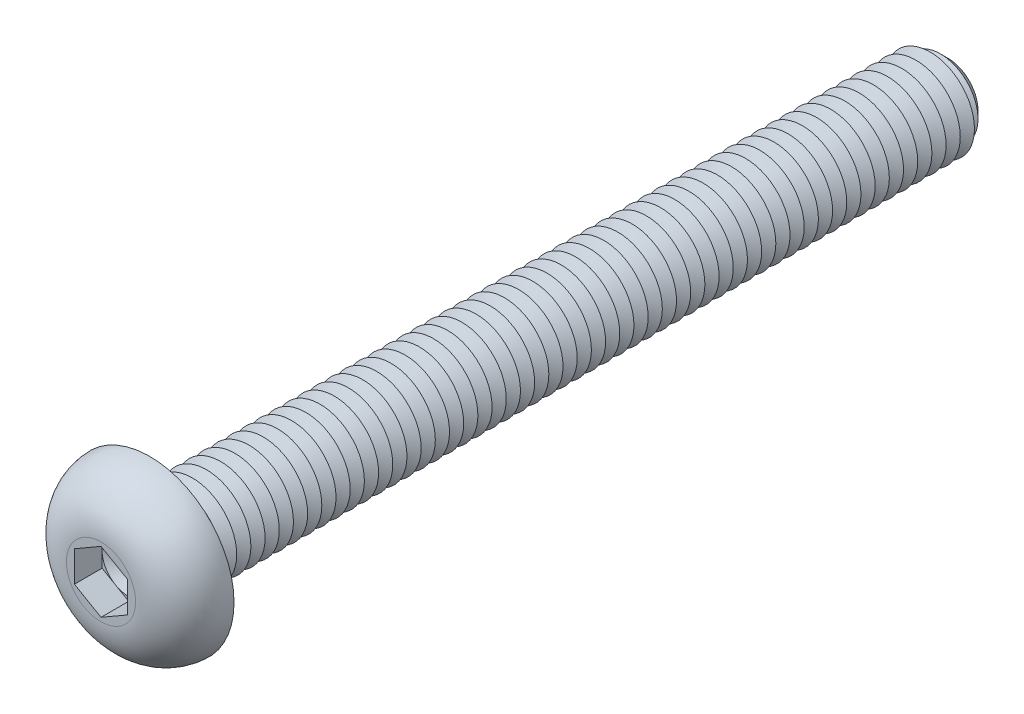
from build123d import *

# Parameters (mm, degrees)
CUT_EXTRUDE1_DEPTH  = 1.56
SKETCH4_R           = 2.5
BOSS_EXTRUDE1_DEPTH = 45
CHAMFER1_SIZE       = 0.8
LPATTERN1_COUNT     = 55
LPATTERN1_PITCH     = 0.8
FILLET2_R           = 0.4


with BuildPart() as part:
    # Sketch2 → Revolve1 (revolve)
    with BuildSketch(Plane(origin=(0, 0, 0), x_dir=(0, 0, -1), z_dir=(1, 0, 0)), mode=Mode.PRIVATE) as revolve1_sk:
        with BuildLine():
            Line((0, 0), (-2.75, 0))
            Line((-2.75, 0), (-2.75, 1.950446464))
            ThreePointArc((-2.75, 1.950446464), (-1.947498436, 3.912588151), (0, 4.75))
            Line((0, 4.75), (0, 0))
        make_face()
    revolve(revolve1_sk.sketch.rotate(Axis((0, 0, 47.934239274), (0, 0, -1)), 90), axis=Axis((0, 0, 47.934239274), (0, 0, -1)))

    # Sketch3 → Cut-Extrude1 (cut)
    with BuildSketch(Plane.XY.offset(2.75)):
        Polygon((0, 1.732050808), (-1.5, 0.866025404), (-1.5, -0.866025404), (0, -1.732050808), (1.5, -0.866025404), (1.5, 0.866025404), align=None)
    extrude(amount=-CUT_EXTRUDE1_DEPTH, mode=Mode.SUBTRACT)

    # Sketch4 → Boss-Extrude1 (add)
    with BuildSketch(Plane(origin=(0, 0, 0), x_dir=(-1, 0, 0), z_dir=(0, 0, -1))):
        with Locations(Location((0, 0, 0), (0, 0, 180))):
            Circle(SKETCH4_R)
    extrude(amount=BOSS_EXTRUDE1_DEPTH)

    # Chamfer1
    chamfer1_edges = [part.edges().sort_by_distance(p)[0] for p in [
        (-2.5, 0, -45),
    ]]
    chamfer(chamfer1_edges, length=CHAMFER1_SIZE)

    # Sketch5 → Cut-Revolve1 (revolve, cut)
    with BuildSketch(Plane(origin=(0, 0, 0), x_dir=(0, 0, -1), z_dir=(1, 0, 0)), mode=Mode.PRIVATE) as cut_revolve1_sk:
        Polygon((0.8, 2.5), (1.6, 2.5), (1.2, 1.807179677), align=None)
    cut_revolve1 = revolve(cut_revolve1_sk.sketch.rotate(Axis((0, 0, 47.934239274), (0, 0, -1)), 90), axis=Axis((0, 0, 47.934239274), (0, 0, -1)), mode=Mode.SUBTRACT)

    # LPattern1: Cut-Revolve1 ×55
    with Locations(*[(0, 0, -i * LPATTERN1_PITCH) for i in range(1, LPATTERN1_COUNT)]):
        add(cut_revolve1, mode=Mode.SUBTRACT)

    # Fillet2
    fillet2_edges = [part.edges().sort_by_distance(p)[0] for p in [
        (-2.5, 0, 0),
    ]]
    fillet(fillet2_edges, radius=FILLET2_R)

    # Cut-Extrude2 cone 1 section (on through the dimple's axis) → Cut-Extrude2 (revolve, cut)
    with BuildSketch(Plane(origin=(0, 0, 1.19), x_dir=(0, -1, 0), z_dir=(1, 0, 0))):
        Polygon((0, 0), (1.5, 0), (0, 0.866025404), align=None)
    revolve(axis=Axis((0, 0, 1.19), (0, 0, -1)), mode=Mode.SUBTRACT)


solid = part.part
